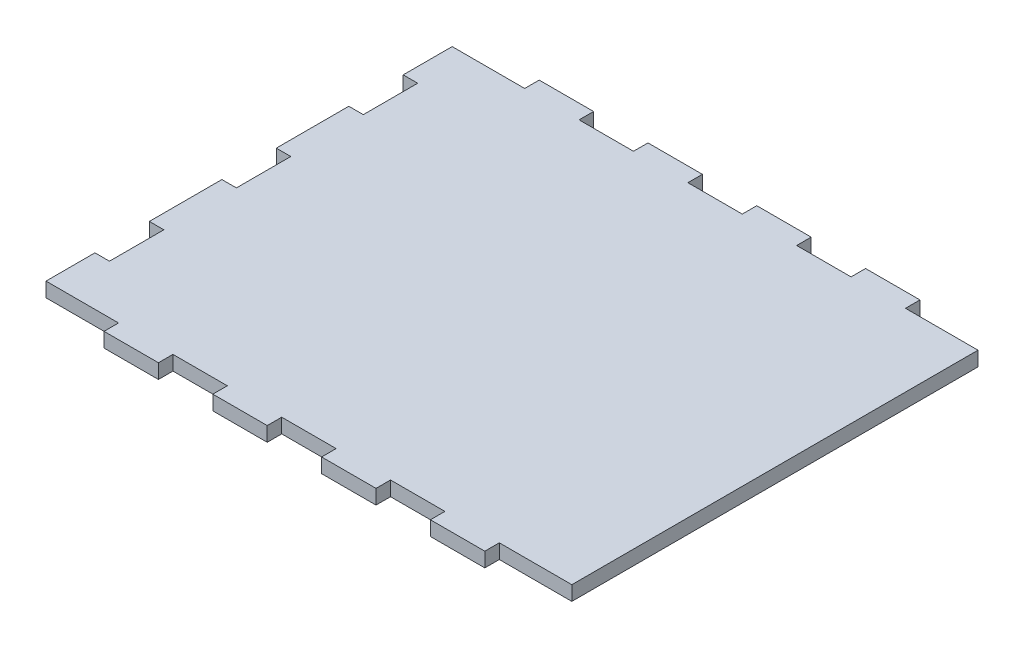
from build123d import *

# Parameters (mm, degrees)
SKETCH1_W               = 145
SKETCH1_H               = 120
BOSS_EXTRUDE1_DEPTH     = 4
SKETCH2_W               = 20
SKETCH2_H               = 4
SKETCH2_W_2             = 15
CUT_EXTRUDE1_DEPTH      = 189.257801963
CUT_EXTRUDE2_DEPTH      = 189.257801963
CUT_EXTRUDE2_DEPTH_BACK = 189.257801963
SKETCH3_W               = 4
SKETCH3_H               = 15


with BuildPart() as part:
    # Sketch1 → Boss-Extrude1 (new body)
    with BuildSketch(Plane(origin=(0, 0, 0), x_dir=(1, 0, 0), z_dir=(0, 1, 0))):
        with Locations((72.5, 60)):
            Rectangle(SKETCH1_W, SKETCH1_H)
    extrude(amount=BOSS_EXTRUDE1_DEPTH)

    # Sketch2 → Cut-Extrude1 (cut, symmetric)
    with BuildSketch(Plane(origin=(0, 4, 0), x_dir=(1, 0, 0), z_dir=(0, 1, 0))):
        with Locations((10, 2)):
            Rectangle(SKETCH2_W, SKETCH2_H)
        with Locations((42.5, 2)):
            Rectangle(SKETCH2_W_2, SKETCH2_H)
        with Locations((102.5, 2)):
            Rectangle(SKETCH2_W_2, SKETCH2_H)
        with Locations((72.5, 2)):
            Rectangle(SKETCH2_W_2, SKETCH2_H)
        with Locations((135, 2)):
            Rectangle(SKETCH2_W, SKETCH2_H)
    cut_extrude1 = extrude(amount=CUT_EXTRUDE1_DEPTH, both=True, mode=Mode.SUBTRACT)

    # Sketch3 → Cut-Extrude2 (cut, two sides: drawn at the far end of the back side and taken through both)
    with BuildSketch(Plane(origin=(0, 4, 0), x_dir=(1, 0, 0), z_dir=(0, 1, 0)).offset(-CUT_EXTRUDE2_DEPTH_BACK)):
        with Locations((2, 95)):
            Rectangle(SKETCH3_W, SKETCH3_H)
        with Locations((2, 60)):
            Rectangle(SKETCH3_W, SKETCH3_H)
        with Locations((2, 25)):
            Rectangle(SKETCH3_W, SKETCH3_H)
    extrude(amount=CUT_EXTRUDE2_DEPTH + CUT_EXTRUDE2_DEPTH_BACK, mode=Mode.SUBTRACT)

    # Mirror1: Cut-Extrude1 across plane
    add(cut_extrude1.mirror(Plane(origin=(0, 0, -60), x_dir=(1, 0, 0), z_dir=(0, 0, -1))), mode=Mode.SUBTRACT)


solid = part.part
